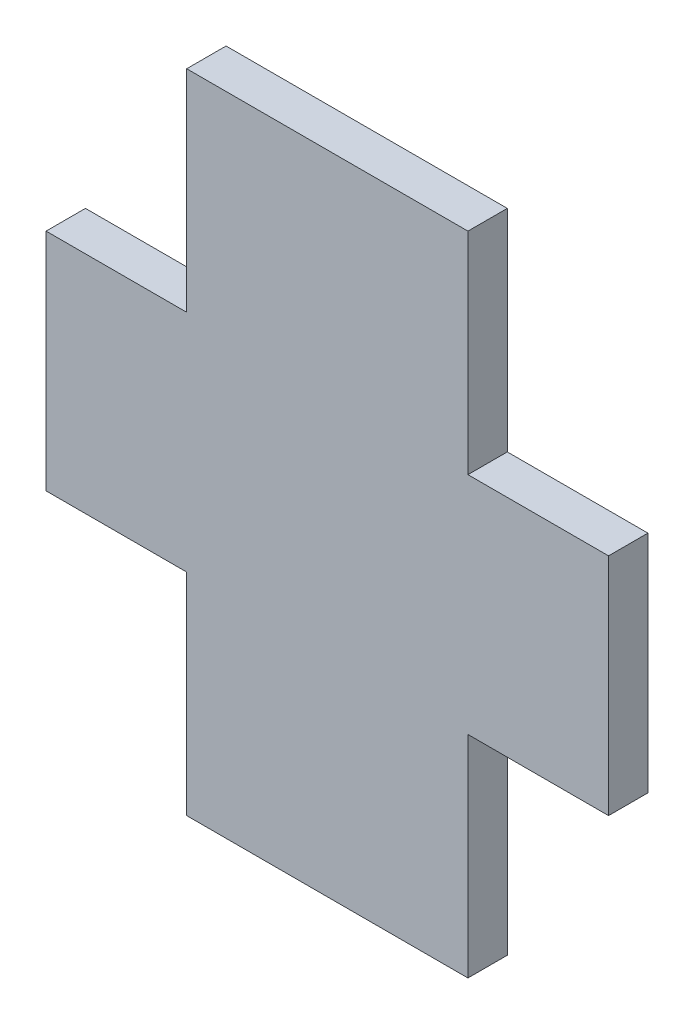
ISO-10303-21;
HEADER;
FILE_DESCRIPTION(('STEP AP214'),'2;1');
FILE_NAME('part.step','',(''),(''),'','','');
FILE_SCHEMA(('AUTOMOTIVE_DESIGN { 1 0 10303 214 1 1 1 1 }'));
ENDSEC;
DATA;
#1=APPLICATION_CONTEXT('core data for automotive mechanical design processes');
#2=APPLICATION_PROTOCOL_DEFINITION('international standard','automotive_design',2000,#1);
#3=PRODUCT_CONTEXT('',#1,'mechanical');
#4=PRODUCT('Part','Part','',(#3));
#5=PRODUCT_RELATED_PRODUCT_CATEGORY('part','',(#4));
#6=PRODUCT_DEFINITION_FORMATION('','',#4);
#7=PRODUCT_DEFINITION_CONTEXT('part definition',#1,'design');
#8=PRODUCT_DEFINITION('design','',#6,#7);
#9=PRODUCT_DEFINITION_SHAPE('','',#8);
#10=(LENGTH_UNIT() NAMED_UNIT(*) SI_UNIT(.MILLI.,.METRE.));
#11=(NAMED_UNIT(*) PLANE_ANGLE_UNIT() SI_UNIT($,.RADIAN.));
#12=(NAMED_UNIT(*) SI_UNIT($,.STERADIAN.) SOLID_ANGLE_UNIT());
#13=UNCERTAINTY_MEASURE_WITH_UNIT(LENGTH_MEASURE(1.E-05),#10,'distance_accuracy_value','');
#14=(GEOMETRIC_REPRESENTATION_CONTEXT(3) GLOBAL_UNCERTAINTY_ASSIGNED_CONTEXT((#13)) GLOBAL_UNIT_ASSIGNED_CONTEXT((#10,
#11,#12)) REPRESENTATION_CONTEXT('',''));
#15=CARTESIAN_POINT('',(0.,0.,0.));
#16=DIRECTION('',(0.,0.,1.));
#17=DIRECTION('',(1.,0.,0.));
#18=AXIS2_PLACEMENT_3D('',#15,#16,#17);
#19=CARTESIAN_POINT('',(-10.,8.,2.8));
#20=DIRECTION('',(0.,-1.,0.));
#21=DIRECTION('',(1.,0.,0.));
#22=AXIS2_PLACEMENT_3D('',#19,#20,#21);
#23=PLANE('',#22);
#24=DIRECTION('',(-1.,0.,0.));
#25=VECTOR('',#24,1.);
#26=CARTESIAN_POINT('',(-10.,8.,0.));
#27=LINE('',#26,#25);
#28=CARTESIAN_POINT('',(-10.,8.,0.));
#29=VERTEX_POINT('',#28);
#30=CARTESIAN_POINT('',(-20.,8.00000000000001,0.));
#31=VERTEX_POINT('',#30);
#32=EDGE_CURVE('E159',#29,#31,#27,.T.);
#33=ORIENTED_EDGE('',*,*,#32,.T.);
#34=DIRECTION('',(0.,0.,-1.));
#35=VECTOR('',#34,1.);
#36=CARTESIAN_POINT('',(-20.,8.00000000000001,2.8));
#37=LINE('',#36,#35);
#38=CARTESIAN_POINT('',(-20.,8.00000000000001,2.8));
#39=VERTEX_POINT('',#38);
#40=EDGE_CURVE('E11',#39,#31,#37,.T.);
#41=ORIENTED_EDGE('',*,*,#40,.F.);
#42=DIRECTION('',(-1.,0.,0.));
#43=VECTOR('',#42,1.);
#44=CARTESIAN_POINT('',(-10.,8.,2.8));
#45=LINE('',#44,#43);
#46=CARTESIAN_POINT('',(-10.,8.,2.8));
#47=VERTEX_POINT('',#46);
#48=EDGE_CURVE('E181',#47,#39,#45,.T.);
#49=ORIENTED_EDGE('',*,*,#48,.F.);
#50=DIRECTION('',(0.,0.,-1.));
#51=VECTOR('',#50,1.);
#52=CARTESIAN_POINT('',(-10.,8.,2.8));
#53=LINE('',#52,#51);
#54=EDGE_CURVE('E151',#47,#29,#53,.T.);
#55=ORIENTED_EDGE('',*,*,#54,.T.);
#56=EDGE_LOOP('',(#33,#41,#49,#55));
#57=FACE_BOUND('',#56,.T.);
#58=ADVANCED_FACE('F39',(#57),#23,.F.);
#59=CARTESIAN_POINT('',(-20.,-8.00000000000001,2.8));
#60=DIRECTION('',(1.,0.,0.));
#61=DIRECTION('',(0.,0.,-1.));
#62=AXIS2_PLACEMENT_3D('',#59,#60,#61);
#63=PLANE('',#62);
#64=DIRECTION('',(0.,-1.,0.));
#65=VECTOR('',#64,1.);
#66=CARTESIAN_POINT('',(-20.,-8.00000000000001,0.));
#67=LINE('',#66,#65);
#68=CARTESIAN_POINT('',(-20.,-8.00000000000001,0.));
#69=VERTEX_POINT('',#68);
#70=EDGE_CURVE('E165',#31,#69,#67,.T.);
#71=ORIENTED_EDGE('',*,*,#70,.T.);
#72=DIRECTION('',(0.,0.,-1.));
#73=VECTOR('',#72,1.);
#74=CARTESIAN_POINT('',(-20.,-8.00000000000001,2.8));
#75=LINE('',#74,#73);
#76=CARTESIAN_POINT('',(-20.,-8.00000000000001,2.8));
#77=VERTEX_POINT('',#76);
#78=EDGE_CURVE('E50',#77,#69,#75,.T.);
#79=ORIENTED_EDGE('',*,*,#78,.F.);
#80=DIRECTION('',(0.,-1.,0.));
#81=VECTOR('',#80,1.);
#82=CARTESIAN_POINT('',(-20.,-8.00000000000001,2.8));
#83=LINE('',#82,#81);
#84=EDGE_CURVE('E106',#39,#77,#83,.T.);
#85=ORIENTED_EDGE('',*,*,#84,.F.);
#86=ORIENTED_EDGE('',*,*,#40,.T.);
#87=EDGE_LOOP('',(#71,#79,#85,#86));
#88=FACE_BOUND('',#87,.T.);
#89=ADVANCED_FACE('F260',(#88),#63,.F.);
#90=CARTESIAN_POINT('',(-9.99999999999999,-8.,2.8));
#91=DIRECTION('',(0.,1.,0.));
#92=DIRECTION('',(-1.,0.,0.));
#93=AXIS2_PLACEMENT_3D('',#90,#91,#92);
#94=PLANE('',#93);
#95=DIRECTION('',(1.,0.,0.));
#96=VECTOR('',#95,1.);
#97=CARTESIAN_POINT('',(-9.99999999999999,-8.,0.));
#98=LINE('',#97,#96);
#99=CARTESIAN_POINT('',(-9.99999999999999,-8.,0.));
#100=VERTEX_POINT('',#99);
#101=EDGE_CURVE('E164',#69,#100,#98,.T.);
#102=ORIENTED_EDGE('',*,*,#101,.T.);
#103=DIRECTION('',(0.,0.,-1.));
#104=VECTOR('',#103,1.);
#105=CARTESIAN_POINT('',(-9.99999999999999,-8.,2.8));
#106=LINE('',#105,#104);
#107=CARTESIAN_POINT('',(-9.99999999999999,-8.,2.8));
#108=VERTEX_POINT('',#107);
#109=EDGE_CURVE('E196',#108,#100,#106,.T.);
#110=ORIENTED_EDGE('',*,*,#109,.F.);
#111=DIRECTION('',(1.,0.,0.));
#112=VECTOR('',#111,1.);
#113=CARTESIAN_POINT('',(-9.99999999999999,-8.,2.8));
#114=LINE('',#113,#112);
#115=EDGE_CURVE('E208',#77,#108,#114,.T.);
#116=ORIENTED_EDGE('',*,*,#115,.F.);
#117=ORIENTED_EDGE('',*,*,#78,.T.);
#118=EDGE_LOOP('',(#102,#110,#116,#117));
#119=FACE_BOUND('',#118,.T.);
#120=ADVANCED_FACE('F207',(#119),#94,.F.);
#121=CARTESIAN_POINT('',(-10.,-23.,2.8));
#122=DIRECTION('',(1.,0.,0.));
#123=DIRECTION('',(0.,1.,0.));
#124=AXIS2_PLACEMENT_3D('',#121,#122,#123);
#125=PLANE('',#124);
#126=DIRECTION('',(0.,-1.,0.));
#127=VECTOR('',#126,1.);
#128=CARTESIAN_POINT('',(-10.,-23.,0.));
#129=LINE('',#128,#127);
#130=CARTESIAN_POINT('',(-10.,-23.,0.));
#131=VERTEX_POINT('',#130);
#132=EDGE_CURVE('E168',#100,#131,#129,.T.);
#133=ORIENTED_EDGE('',*,*,#132,.T.);
#134=DIRECTION('',(0.,0.,-1.));
#135=VECTOR('',#134,1.);
#136=CARTESIAN_POINT('',(-10.,-23.,2.8));
#137=LINE('',#136,#135);
#138=CARTESIAN_POINT('',(-10.,-23.,2.8));
#139=VERTEX_POINT('',#138);
#140=EDGE_CURVE('E200',#139,#131,#137,.T.);
#141=ORIENTED_EDGE('',*,*,#140,.F.);
#142=DIRECTION('',(0.,-1.,0.));
#143=VECTOR('',#142,1.);
#144=CARTESIAN_POINT('',(-10.,-23.,2.8));
#145=LINE('',#144,#143);
#146=EDGE_CURVE('E226',#108,#139,#145,.T.);
#147=ORIENTED_EDGE('',*,*,#146,.F.);
#148=ORIENTED_EDGE('',*,*,#109,.T.);
#149=EDGE_LOOP('',(#133,#141,#147,#148));
#150=FACE_BOUND('',#149,.T.);
#151=ADVANCED_FACE('F220',(#150),#125,.F.);
#152=CARTESIAN_POINT('',(10.,-23.,2.8));
#153=DIRECTION('',(0.,1.,0.));
#154=DIRECTION('',(0.,0.,1.));
#155=AXIS2_PLACEMENT_3D('',#152,#153,#154);
#156=PLANE('',#155);
#157=DIRECTION('',(1.,0.,0.));
#158=VECTOR('',#157,1.);
#159=CARTESIAN_POINT('',(10.,-23.,0.));
#160=LINE('',#159,#158);
#161=CARTESIAN_POINT('',(10.,-23.,0.));
#162=VERTEX_POINT('',#161);
#163=EDGE_CURVE('E166',#131,#162,#160,.T.);
#164=ORIENTED_EDGE('',*,*,#163,.T.);
#165=DIRECTION('',(0.,0.,-1.));
#166=VECTOR('',#165,1.);
#167=CARTESIAN_POINT('',(10.,-23.,2.8));
#168=LINE('',#167,#166);
#169=CARTESIAN_POINT('',(10.,-23.,2.8));
#170=VERTEX_POINT('',#169);
#171=EDGE_CURVE('E191',#170,#162,#168,.T.);
#172=ORIENTED_EDGE('',*,*,#171,.F.);
#173=DIRECTION('',(1.,0.,0.));
#174=VECTOR('',#173,1.);
#175=CARTESIAN_POINT('',(10.,-23.,2.8));
#176=LINE('',#175,#174);
#177=EDGE_CURVE('E223',#139,#170,#176,.T.);
#178=ORIENTED_EDGE('',*,*,#177,.F.);
#179=ORIENTED_EDGE('',*,*,#140,.T.);
#180=EDGE_LOOP('',(#164,#172,#178,#179));
#181=FACE_BOUND('',#180,.T.);
#182=ADVANCED_FACE('F221',(#181),#156,.F.);
#183=CARTESIAN_POINT('',(9.99999999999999,-8.,2.8));
#184=DIRECTION('',(-1.,0.,0.));
#185=DIRECTION('',(0.,-1.,0.));
#186=AXIS2_PLACEMENT_3D('',#183,#184,#185);
#187=PLANE('',#186);
#188=DIRECTION('',(0.,1.,0.));
#189=VECTOR('',#188,1.);
#190=CARTESIAN_POINT('',(9.99999999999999,-8.,0.));
#191=LINE('',#190,#189);
#192=CARTESIAN_POINT('',(9.99999999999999,-8.,0.));
#193=VERTEX_POINT('',#192);
#194=EDGE_CURVE('E169',#162,#193,#191,.T.);
#195=ORIENTED_EDGE('',*,*,#194,.T.);
#196=DIRECTION('',(0.,0.,-1.));
#197=VECTOR('',#196,1.);
#198=CARTESIAN_POINT('',(9.99999999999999,-8.,2.8));
#199=LINE('',#198,#197);
#200=CARTESIAN_POINT('',(9.99999999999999,-8.,2.8));
#201=VERTEX_POINT('',#200);
#202=EDGE_CURVE('E192',#201,#193,#199,.T.);
#203=ORIENTED_EDGE('',*,*,#202,.F.);
#204=DIRECTION('',(0.,1.,0.));
#205=VECTOR('',#204,1.);
#206=CARTESIAN_POINT('',(9.99999999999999,-8.,2.8));
#207=LINE('',#206,#205);
#208=EDGE_CURVE('E224',#170,#201,#207,.T.);
#209=ORIENTED_EDGE('',*,*,#208,.F.);
#210=ORIENTED_EDGE('',*,*,#171,.T.);
#211=EDGE_LOOP('',(#195,#203,#209,#210));
#212=FACE_BOUND('',#211,.T.);
#213=ADVANCED_FACE('F275',(#212),#187,.F.);
#214=CARTESIAN_POINT('',(20.,-8.,2.8));
#215=DIRECTION('',(0.,1.,0.));
#216=DIRECTION('',(-1.,0.,0.));
#217=AXIS2_PLACEMENT_3D('',#214,#215,#216);
#218=PLANE('',#217);
#219=DIRECTION('',(1.,0.,0.));
#220=VECTOR('',#219,1.);
#221=CARTESIAN_POINT('',(20.,-8.,0.));
#222=LINE('',#221,#220);
#223=CARTESIAN_POINT('',(20.,-8.,0.));
#224=VERTEX_POINT('',#223);
#225=EDGE_CURVE('E175',#193,#224,#222,.T.);
#226=ORIENTED_EDGE('',*,*,#225,.T.);
#227=DIRECTION('',(0.,0.,-1.));
#228=VECTOR('',#227,1.);
#229=CARTESIAN_POINT('',(20.,-8.,2.8));
#230=LINE('',#229,#228);
#231=CARTESIAN_POINT('',(20.,-8.,2.8));
#232=VERTEX_POINT('',#231);
#233=EDGE_CURVE('E187',#232,#224,#230,.T.);
#234=ORIENTED_EDGE('',*,*,#233,.F.);
#235=DIRECTION('',(1.,0.,0.));
#236=VECTOR('',#235,1.);
#237=CARTESIAN_POINT('',(20.,-8.,2.8));
#238=LINE('',#237,#236);
#239=EDGE_CURVE('E228',#201,#232,#238,.T.);
#240=ORIENTED_EDGE('',*,*,#239,.F.);
#241=ORIENTED_EDGE('',*,*,#202,.T.);
#242=EDGE_LOOP('',(#226,#234,#240,#241));
#243=FACE_BOUND('',#242,.T.);
#244=ADVANCED_FACE('F274',(#243),#218,.F.);
#245=CARTESIAN_POINT('',(20.,-8.,2.8));
#246=DIRECTION('',(-1.,0.,0.));
#247=DIRECTION('',(0.,0.,1.));
#248=AXIS2_PLACEMENT_3D('',#245,#246,#247);
#249=PLANE('',#248);
#250=DIRECTION('',(0.,1.,0.));
#251=VECTOR('',#250,1.);
#252=CARTESIAN_POINT('',(20.,-8.,0.));
#253=LINE('',#252,#251);
#254=CARTESIAN_POINT('',(20.,8.,0.));
#255=VERTEX_POINT('',#254);
#256=EDGE_CURVE('E174',#224,#255,#253,.T.);
#257=ORIENTED_EDGE('',*,*,#256,.T.);
#258=DIRECTION('',(0.,0.,-1.));
#259=VECTOR('',#258,1.);
#260=CARTESIAN_POINT('',(20.,8.,2.8));
#261=LINE('',#260,#259);
#262=CARTESIAN_POINT('',(20.,8.,2.8));
#263=VERTEX_POINT('',#262);
#264=EDGE_CURVE('E184',#263,#255,#261,.T.);
#265=ORIENTED_EDGE('',*,*,#264,.F.);
#266=DIRECTION('',(0.,1.,0.));
#267=VECTOR('',#266,1.);
#268=CARTESIAN_POINT('',(20.,-8.,2.8));
#269=LINE('',#268,#267);
#270=EDGE_CURVE('E233',#232,#263,#269,.T.);
#271=ORIENTED_EDGE('',*,*,#270,.F.);
#272=ORIENTED_EDGE('',*,*,#233,.T.);
#273=EDGE_LOOP('',(#257,#265,#271,#272));
#274=FACE_BOUND('',#273,.T.);
#275=ADVANCED_FACE('F238',(#274),#249,.F.);
#276=CARTESIAN_POINT('',(20.,8.,2.8));
#277=DIRECTION('',(0.,-1.,0.));
#278=DIRECTION('',(1.,0.,0.));
#279=AXIS2_PLACEMENT_3D('',#276,#277,#278);
#280=PLANE('',#279);
#281=DIRECTION('',(-1.,0.,0.));
#282=VECTOR('',#281,1.);
#283=CARTESIAN_POINT('',(20.,8.,0.));
#284=LINE('',#283,#282);
#285=CARTESIAN_POINT('',(10.,8.,0.));
#286=VERTEX_POINT('',#285);
#287=EDGE_CURVE('E176',#255,#286,#284,.T.);
#288=ORIENTED_EDGE('',*,*,#287,.T.);
#289=DIRECTION('',(0.,0.,-1.));
#290=VECTOR('',#289,1.);
#291=CARTESIAN_POINT('',(10.,8.,2.8));
#292=LINE('',#291,#290);
#293=CARTESIAN_POINT('',(10.,8.,2.8));
#294=VERTEX_POINT('',#293);
#295=EDGE_CURVE('E148',#294,#286,#292,.T.);
#296=ORIENTED_EDGE('',*,*,#295,.F.);
#297=DIRECTION('',(-1.,0.,0.));
#298=VECTOR('',#297,1.);
#299=CARTESIAN_POINT('',(20.,8.,2.8));
#300=LINE('',#299,#298);
#301=EDGE_CURVE('E141',#263,#294,#300,.T.);
#302=ORIENTED_EDGE('',*,*,#301,.F.);
#303=ORIENTED_EDGE('',*,*,#264,.T.);
#304=EDGE_LOOP('',(#288,#296,#302,#303));
#305=FACE_BOUND('',#304,.T.);
#306=ADVANCED_FACE('F244',(#305),#280,.F.);
#307=CARTESIAN_POINT('',(10.,23.,2.8));
#308=DIRECTION('',(-1.,0.,0.));
#309=DIRECTION('',(0.,-1.,0.));
#310=AXIS2_PLACEMENT_3D('',#307,#308,#309);
#311=PLANE('',#310);
#312=DIRECTION('',(0.,1.,0.));
#313=VECTOR('',#312,1.);
#314=CARTESIAN_POINT('',(10.,23.,0.));
#315=LINE('',#314,#313);
#316=CARTESIAN_POINT('',(10.,23.,0.));
#317=VERTEX_POINT('',#316);
#318=EDGE_CURVE('E146',#286,#317,#315,.T.);
#319=ORIENTED_EDGE('',*,*,#318,.T.);
#320=DIRECTION('',(0.,0.,-1.));
#321=VECTOR('',#320,1.);
#322=CARTESIAN_POINT('',(10.,23.,2.8));
#323=LINE('',#322,#321);
#324=CARTESIAN_POINT('',(10.,23.,2.8));
#325=VERTEX_POINT('',#324);
#326=EDGE_CURVE('E147',#325,#317,#323,.T.);
#327=ORIENTED_EDGE('',*,*,#326,.F.);
#328=DIRECTION('',(0.,1.,0.));
#329=VECTOR('',#328,1.);
#330=CARTESIAN_POINT('',(10.,23.,2.8));
#331=LINE('',#330,#329);
#332=EDGE_CURVE('E134',#294,#325,#331,.T.);
#333=ORIENTED_EDGE('',*,*,#332,.F.);
#334=ORIENTED_EDGE('',*,*,#295,.T.);
#335=EDGE_LOOP('',(#319,#327,#333,#334));
#336=FACE_BOUND('',#335,.T.);
#337=ADVANCED_FACE('F150',(#336),#311,.F.);
#338=CARTESIAN_POINT('',(-10.,23.,2.8));
#339=DIRECTION('',(0.,-1.,0.));
#340=DIRECTION('',(1.,0.,0.));
#341=AXIS2_PLACEMENT_3D('',#338,#339,#340);
#342=PLANE('',#341);
#343=DIRECTION('',(-1.,0.,0.));
#344=VECTOR('',#343,1.);
#345=CARTESIAN_POINT('',(-10.,23.,0.));
#346=LINE('',#345,#344);
#347=CARTESIAN_POINT('',(-10.,23.,0.));
#348=VERTEX_POINT('',#347);
#349=EDGE_CURVE('E96',#317,#348,#346,.T.);
#350=ORIENTED_EDGE('',*,*,#349,.T.);
#351=DIRECTION('',(0.,0.,-1.));
#352=VECTOR('',#351,1.);
#353=CARTESIAN_POINT('',(-10.,23.,2.8));
#354=LINE('',#353,#352);
#355=CARTESIAN_POINT('',(-10.,23.,2.8));
#356=VERTEX_POINT('',#355);
#357=EDGE_CURVE('E152',#356,#348,#354,.T.);
#358=ORIENTED_EDGE('',*,*,#357,.F.);
#359=DIRECTION('',(-1.,0.,0.));
#360=VECTOR('',#359,1.);
#361=CARTESIAN_POINT('',(-10.,23.,2.8));
#362=LINE('',#361,#360);
#363=EDGE_CURVE('E137',#325,#356,#362,.T.);
#364=ORIENTED_EDGE('',*,*,#363,.F.);
#365=ORIENTED_EDGE('',*,*,#326,.T.);
#366=EDGE_LOOP('',(#350,#358,#364,#365));
#367=FACE_BOUND('',#366,.T.);
#368=ADVANCED_FACE('F153',(#367),#342,.F.);
#369=CARTESIAN_POINT('',(-10.,8.,2.8));
#370=DIRECTION('',(1.,0.,0.));
#371=DIRECTION('',(0.,1.,0.));
#372=AXIS2_PLACEMENT_3D('',#369,#370,#371);
#373=PLANE('',#372);
#374=DIRECTION('',(0.,-1.,0.));
#375=VECTOR('',#374,1.);
#376=CARTESIAN_POINT('',(-10.,8.,0.));
#377=LINE('',#376,#375);
#378=EDGE_CURVE('E105',#348,#29,#377,.T.);
#379=ORIENTED_EDGE('',*,*,#378,.T.);
#380=ORIENTED_EDGE('',*,*,#54,.F.);
#381=DIRECTION('',(0.,-1.,0.));
#382=VECTOR('',#381,1.);
#383=CARTESIAN_POINT('',(-10.,8.,2.8));
#384=LINE('',#383,#382);
#385=EDGE_CURVE('E54',#356,#47,#384,.T.);
#386=ORIENTED_EDGE('',*,*,#385,.F.);
#387=ORIENTED_EDGE('',*,*,#357,.T.);
#388=EDGE_LOOP('',(#379,#380,#386,#387));
#389=FACE_BOUND('',#388,.T.);
#390=ADVANCED_FACE('F246',(#389),#373,.F.);
#391=CARTESIAN_POINT('',(0.,0.,2.8));
#392=DIRECTION('',(0.,0.,-1.));
#393=DIRECTION('',(-1.,0.,0.));
#394=AXIS2_PLACEMENT_3D('',#391,#392,#393);
#395=PLANE('',#394);
#396=ORIENTED_EDGE('',*,*,#48,.T.);
#397=ORIENTED_EDGE('',*,*,#84,.T.);
#398=ORIENTED_EDGE('',*,*,#115,.T.);
#399=ORIENTED_EDGE('',*,*,#146,.T.);
#400=ORIENTED_EDGE('',*,*,#177,.T.);
#401=ORIENTED_EDGE('',*,*,#208,.T.);
#402=ORIENTED_EDGE('',*,*,#239,.T.);
#403=ORIENTED_EDGE('',*,*,#270,.T.);
#404=ORIENTED_EDGE('',*,*,#301,.T.);
#405=ORIENTED_EDGE('',*,*,#332,.T.);
#406=ORIENTED_EDGE('',*,*,#363,.T.);
#407=ORIENTED_EDGE('',*,*,#385,.T.);
#408=EDGE_LOOP('',(#396,#397,#398,#399,#400,#401,#402,#403,#404,#405,#406,#407));
#409=FACE_BOUND('',#408,.T.);
#410=ADVANCED_FACE('F140',(#409),#395,.F.);
#411=CARTESIAN_POINT('',(0.,0.,0.));
#412=DIRECTION('',(0.,0.,-1.));
#413=DIRECTION('',(-1.,0.,0.));
#414=AXIS2_PLACEMENT_3D('',#411,#412,#413);
#415=PLANE('',#414);
#416=ORIENTED_EDGE('',*,*,#32,.F.);
#417=ORIENTED_EDGE('',*,*,#378,.F.);
#418=ORIENTED_EDGE('',*,*,#349,.F.);
#419=ORIENTED_EDGE('',*,*,#318,.F.);
#420=ORIENTED_EDGE('',*,*,#287,.F.);
#421=ORIENTED_EDGE('',*,*,#256,.F.);
#422=ORIENTED_EDGE('',*,*,#225,.F.);
#423=ORIENTED_EDGE('',*,*,#194,.F.);
#424=ORIENTED_EDGE('',*,*,#163,.F.);
#425=ORIENTED_EDGE('',*,*,#132,.F.);
#426=ORIENTED_EDGE('',*,*,#101,.F.);
#427=ORIENTED_EDGE('',*,*,#70,.F.);
#428=EDGE_LOOP('',(#416,#417,#418,#419,#420,#421,#422,#423,#424,#425,#426,#427));
#429=FACE_BOUND('',#428,.T.);
#430=ADVANCED_FACE('F212',(#429),#415,.T.);
#431=CLOSED_SHELL('',(#58,#89,#120,#151,#182,#213,#244,#275,#306,#337,#368,#390,#410,#430));
#432=MANIFOLD_SOLID_BREP('B2',#431);
#433=ADVANCED_BREP_SHAPE_REPRESENTATION('',(#18,#432),#14);
#434=SHAPE_DEFINITION_REPRESENTATION(#9,#433);
ENDSEC;
END-ISO-10303-21;
